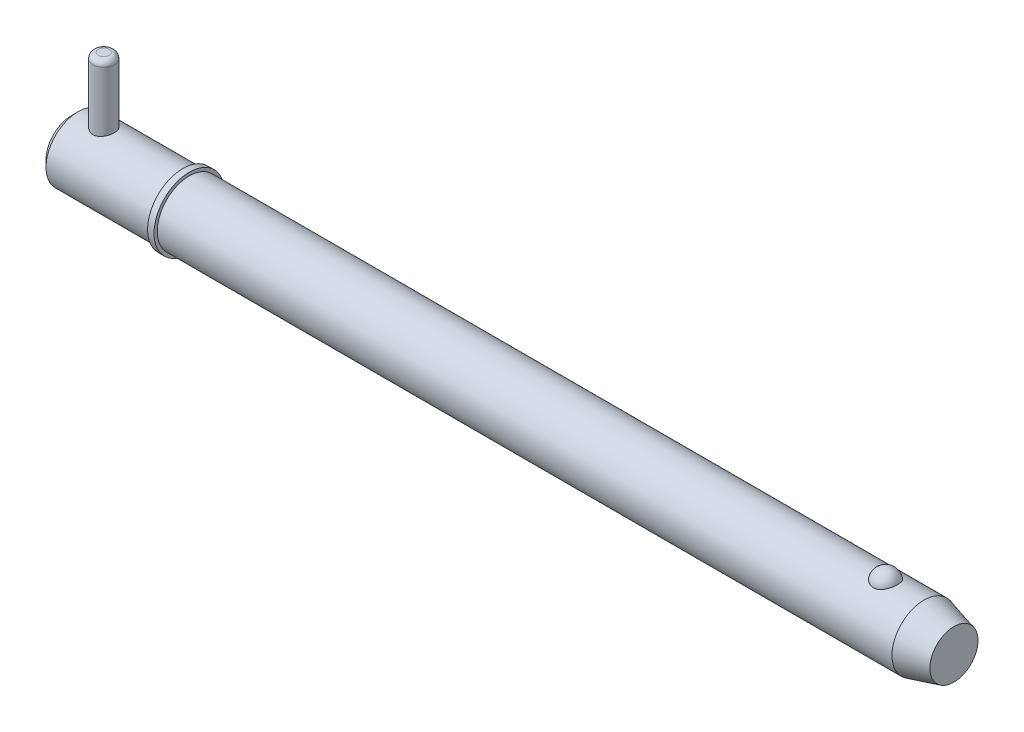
ISO-10303-21;
HEADER;
FILE_DESCRIPTION(('STEP AP214'),'2;1');
FILE_NAME('part.step','',(''),(''),'','','');
FILE_SCHEMA(('AUTOMOTIVE_DESIGN { 1 0 10303 214 1 1 1 1 }'));
ENDSEC;
DATA;
#1=APPLICATION_CONTEXT('core data for automotive mechanical design processes');
#2=APPLICATION_PROTOCOL_DEFINITION('international standard','automotive_design',2000,#1);
#3=PRODUCT_CONTEXT('',#1,'mechanical');
#4=PRODUCT('Part','Part','',(#3));
#5=PRODUCT_RELATED_PRODUCT_CATEGORY('part','',(#4));
#6=PRODUCT_DEFINITION_FORMATION('','',#4);
#7=PRODUCT_DEFINITION_CONTEXT('part definition',#1,'design');
#8=PRODUCT_DEFINITION('design','',#6,#7);
#9=PRODUCT_DEFINITION_SHAPE('','',#8);
#10=(LENGTH_UNIT() NAMED_UNIT(*) SI_UNIT(.MILLI.,.METRE.));
#11=(NAMED_UNIT(*) PLANE_ANGLE_UNIT() SI_UNIT($,.RADIAN.));
#12=(NAMED_UNIT(*) SI_UNIT($,.STERADIAN.) SOLID_ANGLE_UNIT());
#13=UNCERTAINTY_MEASURE_WITH_UNIT(LENGTH_MEASURE(1.E-05),#10,'distance_accuracy_value','');
#14=(GEOMETRIC_REPRESENTATION_CONTEXT(3) GLOBAL_UNCERTAINTY_ASSIGNED_CONTEXT((#13)) GLOBAL_UNIT_ASSIGNED_CONTEXT((#10,
#11,#12)) REPRESENTATION_CONTEXT('',''));
#15=CARTESIAN_POINT('',(0.,0.,0.));
#16=DIRECTION('',(0.,0.,1.));
#17=DIRECTION('',(1.,0.,0.));
#18=AXIS2_PLACEMENT_3D('',#15,#16,#17);
#19=CARTESIAN_POINT('',(9.52500000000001,28.575,0.));
#20=DIRECTION('',(0.,-1.,0.));
#21=DIRECTION('',(0.,0.,-1.));
#22=AXIS2_PLACEMENT_3D('',#19,#20,#21);
#23=CYLINDRICAL_SURFACE('',#22,3.175);
#24=CARTESIAN_POINT('',(9.52500000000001,-7.93750000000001,0.));
#25=DIRECTION('',(0.,1.,0.));
#26=DIRECTION('',(0.,0.,1.));
#27=AXIS2_PLACEMENT_3D('',#24,#25,#26);
#28=CIRCLE('',#27,3.175);
#29=CARTESIAN_POINT('',(9.52500000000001,-7.93750000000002,-3.175));
#30=VERTEX_POINT('',#29);
#31=EDGE_CURVE('P0_E25',#30,#30,#28,.T.);
#32=CARTESIAN_POINT('',(9.52500000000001,26.9875,0.));
#33=DIRECTION('',(0.,1.,0.));
#34=DIRECTION('',(0.,0.,1.));
#35=AXIS2_PLACEMENT_3D('',#32,#33,#34);
#36=CIRCLE('',#35,3.175);
#37=CARTESIAN_POINT('',(9.52500000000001,26.9875,-3.175));
#38=VERTEX_POINT('',#37);
#39=EDGE_CURVE('P0_E29',#38,#38,#36,.F.);
#40=CARTESIAN_POINT('',(9.52500000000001,-7.93750000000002,-3.175));
#41=CARTESIAN_POINT('',(9.52500000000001,-7.57369791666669,-3.175));
#42=CARTESIAN_POINT('',(9.52500000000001,-7.20989583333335,-3.175));
#43=CARTESIAN_POINT('',(9.52500000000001,-6.48229166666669,-3.175));
#44=CARTESIAN_POINT('',(9.52500000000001,-6.11848958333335,-3.175));
#45=CARTESIAN_POINT('',(9.52500000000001,-5.39088541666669,-3.175));
#46=CARTESIAN_POINT('',(9.52500000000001,-5.02708333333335,-3.175));
#47=CARTESIAN_POINT('',(9.52500000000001,-4.29947916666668,-3.175));
#48=CARTESIAN_POINT('',(9.52500000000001,-3.93567708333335,-3.175));
#49=CARTESIAN_POINT('',(9.52500000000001,-3.20807291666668,-3.175));
#50=CARTESIAN_POINT('',(9.52500000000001,-2.84427083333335,-3.175));
#51=CARTESIAN_POINT('',(9.52500000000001,-2.11666666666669,-3.175));
#52=CARTESIAN_POINT('',(9.52500000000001,-1.75286458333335,-3.175));
#53=CARTESIAN_POINT('',(9.52500000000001,-1.02526041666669,-3.175));
#54=CARTESIAN_POINT('',(9.52500000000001,-0.661458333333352,-3.175));
#55=CARTESIAN_POINT('',(9.52500000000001,0.0661458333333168,-3.175));
#56=CARTESIAN_POINT('',(9.52500000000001,0.429947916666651,-3.175));
#57=CARTESIAN_POINT('',(9.52500000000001,1.15755208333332,-3.175));
#58=CARTESIAN_POINT('',(9.52500000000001,1.52135416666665,-3.175));
#59=CARTESIAN_POINT('',(9.52500000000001,2.24895833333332,-3.175));
#60=CARTESIAN_POINT('',(9.52500000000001,2.61276041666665,-3.175));
#61=CARTESIAN_POINT('',(9.52500000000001,3.34036458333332,-3.175));
#62=CARTESIAN_POINT('',(9.52500000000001,3.70416666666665,-3.175));
#63=CARTESIAN_POINT('',(9.52500000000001,4.43177083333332,-3.175));
#64=CARTESIAN_POINT('',(9.52500000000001,4.79557291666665,-3.175));
#65=CARTESIAN_POINT('',(9.52500000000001,5.52317708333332,-3.175));
#66=CARTESIAN_POINT('',(9.52500000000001,5.88697916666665,-3.175));
#67=CARTESIAN_POINT('',(9.52500000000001,6.61458333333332,-3.175));
#68=CARTESIAN_POINT('',(9.52500000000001,6.97838541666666,-3.175));
#69=CARTESIAN_POINT('',(9.52500000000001,7.70598958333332,-3.175));
#70=CARTESIAN_POINT('',(9.52500000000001,8.06979166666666,-3.175));
#71=CARTESIAN_POINT('',(9.52500000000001,8.79739583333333,-3.175));
#72=CARTESIAN_POINT('',(9.52500000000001,9.16119791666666,-3.175));
#73=CARTESIAN_POINT('',(9.52500000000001,9.88880208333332,-3.175));
#74=CARTESIAN_POINT('',(9.52500000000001,10.2526041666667,-3.175));
#75=CARTESIAN_POINT('',(9.52500000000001,10.9802083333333,-3.175));
#76=CARTESIAN_POINT('',(9.52500000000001,11.3440104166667,-3.175));
#77=CARTESIAN_POINT('',(9.52500000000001,12.0716145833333,-3.175));
#78=CARTESIAN_POINT('',(9.52500000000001,12.4354166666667,-3.175));
#79=CARTESIAN_POINT('',(9.52500000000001,13.1630208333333,-3.175));
#80=CARTESIAN_POINT('',(9.52500000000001,13.5268229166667,-3.175));
#81=CARTESIAN_POINT('',(9.52500000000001,14.2544270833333,-3.175));
#82=CARTESIAN_POINT('',(9.52500000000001,14.6182291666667,-3.175));
#83=CARTESIAN_POINT('',(9.52500000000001,15.3458333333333,-3.175));
#84=CARTESIAN_POINT('',(9.52500000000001,15.7096354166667,-3.175));
#85=CARTESIAN_POINT('',(9.52500000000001,16.4372395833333,-3.175));
#86=CARTESIAN_POINT('',(9.52500000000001,16.8010416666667,-3.175));
#87=CARTESIAN_POINT('',(9.52500000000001,17.5286458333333,-3.175));
#88=CARTESIAN_POINT('',(9.52500000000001,17.8924479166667,-3.175));
#89=CARTESIAN_POINT('',(9.52500000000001,18.6200520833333,-3.175));
#90=CARTESIAN_POINT('',(9.52500000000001,18.9838541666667,-3.175));
#91=CARTESIAN_POINT('',(9.52500000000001,19.7114583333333,-3.175));
#92=CARTESIAN_POINT('',(9.52500000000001,20.0752604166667,-3.175));
#93=CARTESIAN_POINT('',(9.52500000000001,20.8028645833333,-3.175));
#94=CARTESIAN_POINT('',(9.52500000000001,21.1666666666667,-3.175));
#95=CARTESIAN_POINT('',(9.52500000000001,21.8942708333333,-3.175));
#96=CARTESIAN_POINT('',(9.52500000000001,22.2580729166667,-3.175));
#97=CARTESIAN_POINT('',(9.52500000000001,22.9856770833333,-3.175));
#98=CARTESIAN_POINT('',(9.52500000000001,23.3494791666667,-3.175));
#99=CARTESIAN_POINT('',(9.52500000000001,24.0770833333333,-3.175));
#100=CARTESIAN_POINT('',(9.52500000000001,24.4408854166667,-3.175));
#101=CARTESIAN_POINT('',(9.52500000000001,25.1684895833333,-3.175));
#102=CARTESIAN_POINT('',(9.52500000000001,25.5322916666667,-3.175));
#103=CARTESIAN_POINT('',(9.52500000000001,26.2598958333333,-3.175));
#104=CARTESIAN_POINT('',(9.52500000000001,26.6236979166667,-3.175));
#105=CARTESIAN_POINT('',(9.52500000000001,26.9875,-3.175));
#106=B_SPLINE_CURVE_WITH_KNOTS('',3,(#40,#41,#42,#43,#44,#45,#46,#47,#48,#49,#50,#51,#52,#53,
#54,#55,#56,#57,#58,#59,#60,#61,#62,#63,#64,#65,#66,#67,#68,#69,#70,#71,#72,#73,#74,#75,#76,#77,
#78,#79,#80,#81,#82,#83,#84,#85,#86,#87,#88,#89,#90,#91,#92,#93,#94,#95,#96,#97,#98,#99,#100,
#101,#102,#103,#104,#105),.UNSPECIFIED.,.F.,.F.,(4,2,2,2,2,2,2,2,2,2,2,2,2,2,2,2,2,2,2,2,2,2,2,
2,2,2,2,2,2,2,2,2,4),(0.,1.09140625,2.1828125,3.27421875,4.365625,5.45703125,6.5484375,
7.63984375,8.73125000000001,9.82265625,10.9140625,12.00546875,13.096875,14.18828125,15.2796875,
16.37109375,17.4625,18.55390625,19.6453125,20.73671875,21.828125,22.91953125,24.0109375,
25.10234375,26.19375,27.28515625,28.3765625,29.46796875,30.559375,31.65078125,32.7421875,
33.83359375,34.925),.UNSPECIFIED.);
#107=EDGE_CURVE('P0_BSEAM14',#30,#38,#106,.T.);
#108=ORIENTED_EDGE('',*,*,#31,.T.);
#109=ORIENTED_EDGE('',*,*,#39,.T.);
#110=ORIENTED_EDGE('',*,*,#107,.T.);
#111=ORIENTED_EDGE('',*,*,#107,.F.);
#112=EDGE_LOOP('',(#108,#110,#109,#111));
#113=FACE_BOUND('',#112,.T.);
#114=ADVANCED_FACE('P0_F14',(#113),#23,.T.);
#115=CARTESIAN_POINT('',(9.52500000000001,28.575,0.));
#116=DIRECTION('',(0.,1.,0.));
#117=DIRECTION('',(0.,0.,1.));
#118=AXIS2_PLACEMENT_3D('',#115,#116,#117);
#119=PLANE('',#118);
#120=CARTESIAN_POINT('',(9.52500000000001,28.575,0.));
#121=DIRECTION('',(0.,1.,0.));
#122=DIRECTION('',(0.,0.,1.));
#123=AXIS2_PLACEMENT_3D('',#120,#121,#122);
#124=CIRCLE('',#123,1.5875);
#125=CARTESIAN_POINT('',(9.52500000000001,28.575,1.5875));
#126=VERTEX_POINT('',#125);
#127=EDGE_CURVE('P0_E10',#126,#126,#124,.T.);
#128=ORIENTED_EDGE('',*,*,#127,.T.);
#129=EDGE_LOOP('',(#128));
#130=FACE_BOUND('',#129,.T.);
#131=ADVANCED_FACE('P0_F46',(#130),#119,.T.);
#132=CARTESIAN_POINT('',(9.52500000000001,-9.525,0.));
#133=DIRECTION('',(0.,1.,0.));
#134=DIRECTION('',(0.,0.,1.));
#135=AXIS2_PLACEMENT_3D('',#132,#133,#134);
#136=PLANE('',#135);
#137=CARTESIAN_POINT('',(9.52500000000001,-9.525,0.));
#138=DIRECTION('',(0.,1.,0.));
#139=DIRECTION('',(0.,0.,1.));
#140=AXIS2_PLACEMENT_3D('',#137,#138,#139);
#141=CIRCLE('',#140,1.5875);
#142=CARTESIAN_POINT('',(9.52500000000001,-9.525,1.5875));
#143=VERTEX_POINT('',#142);
#144=EDGE_CURVE('P0_E21',#143,#143,#141,.F.);
#145=ORIENTED_EDGE('',*,*,#144,.T.);
#146=EDGE_LOOP('',(#145));
#147=FACE_BOUND('',#146,.T.);
#148=ADVANCED_FACE('P0_F43',(#147),#136,.F.);
#149=CARTESIAN_POINT('',(9.52500000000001,-7.9375,0.));
#150=DIRECTION('',(0.,1.,0.));
#151=DIRECTION('',(0.,0.,1.));
#152=AXIS2_PLACEMENT_3D('',#149,#150,#151);
#153=DEGENERATE_TOROIDAL_SURFACE('',#152,1.5875,1.5875,.T.);
#154=ORIENTED_EDGE('',*,*,#144,.F.);
#155=EDGE_LOOP('',(#154));
#156=FACE_BOUND('',#155,.T.);
#157=ORIENTED_EDGE('',*,*,#31,.F.);
#158=EDGE_LOOP('',(#157));
#159=FACE_BOUND('',#158,.T.);
#160=ADVANCED_FACE('P0_F38',(#156,#159),#153,.T.);
#161=CARTESIAN_POINT('',(9.52500000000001,26.9875,0.));
#162=DIRECTION('',(0.,1.,0.));
#163=DIRECTION('',(0.,0.,1.));
#164=AXIS2_PLACEMENT_3D('',#161,#162,#163);
#165=DEGENERATE_TOROIDAL_SURFACE('',#164,1.5875,1.5875,.T.);
#166=ORIENTED_EDGE('',*,*,#39,.F.);
#167=EDGE_LOOP('',(#166));
#168=FACE_BOUND('',#167,.T.);
#169=ORIENTED_EDGE('',*,*,#127,.F.);
#170=EDGE_LOOP('',(#169));
#171=FACE_BOUND('',#170,.T.);
#172=ADVANCED_FACE('P0_F16',(#168,#171),#165,.T.);
#173=CLOSED_SHELL('',(#114,#131,#148,#160,#172));
#174=MANIFOLD_SOLID_BREP('P0_B1',#173);
#175=CARTESIAN_POINT('',(0.,0.,0.));
#176=DIRECTION('',(1.,0.,0.));
#177=DIRECTION('',(0.,0.,-1.));
#178=AXIS2_PLACEMENT_3D('',#175,#176,#177);
#179=CYLINDRICAL_SURFACE('',#178,9.525);
#180=CARTESIAN_POINT('',(253.043054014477,0.,0.));
#181=DIRECTION('',(1.,0.,0.));
#182=DIRECTION('',(0.,0.,-1.));
#183=AXIS2_PLACEMENT_3D('',#180,#181,#182);
#184=CIRCLE('',#183,9.525);
#185=CARTESIAN_POINT('',(253.043054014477,0.,-9.525));
#186=VERTEX_POINT('',#185);
#187=EDGE_CURVE('P1_E81',#186,#186,#184,.T.);
#188=ORIENTED_EDGE('',*,*,#187,.F.);
#189=EDGE_LOOP('',(#188));
#190=FACE_BOUND('',#189,.T.);
#191=CARTESIAN_POINT('',(34.93,0.,0.));
#192=DIRECTION('',(1.,0.,0.));
#193=DIRECTION('',(0.,0.,-1.));
#194=AXIS2_PLACEMENT_3D('',#191,#192,#193);
#195=CIRCLE('',#194,9.525);
#196=CARTESIAN_POINT('',(34.93,0.,-9.525));
#197=VERTEX_POINT('',#196);
#198=EDGE_CURVE('P1_E85',#197,#197,#195,.T.);
#199=ORIENTED_EDGE('',*,*,#198,.T.);
#200=EDGE_LOOP('',(#199));
#201=FACE_BOUND('',#200,.T.);
#202=CARTESIAN_POINT('',(241.645757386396,8.80405803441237,3.63513233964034));
#203=CARTESIAN_POINT('',(241.551676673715,8.80405953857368,3.63513053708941));
#204=CARTESIAN_POINT('',(241.457561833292,8.80561325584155,3.63137461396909));
#205=CARTESIAN_POINT('',(241.270012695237,8.81177748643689,3.61638665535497));
#206=CARTESIAN_POINT('',(241.176578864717,8.81638992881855,3.60514990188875));
#207=CARTESIAN_POINT('',(240.897945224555,8.83467114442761,3.56024627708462));
#208=CARTESIAN_POINT('',(240.714691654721,8.85278327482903,3.51538626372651));
#209=CARTESIAN_POINT('',(240.359509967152,8.89871214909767,3.39742145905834));
#210=CARTESIAN_POINT('',(240.187553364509,8.92650327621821,3.32439116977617));
#211=CARTESIAN_POINT('',(239.858707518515,8.98874819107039,3.15220244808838));
#212=CARTESIAN_POINT('',(239.701811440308,9.02319893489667,3.05305594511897));
#213=CARTESIAN_POINT('',(239.402214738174,9.09629186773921,2.82797815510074));
#214=CARTESIAN_POINT('',(239.260060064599,9.13502685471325,2.70135138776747));
#215=CARTESIAN_POINT('',(238.998299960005,9.21186572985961,2.42641932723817));
#216=CARTESIAN_POINT('',(238.878701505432,9.24996941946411,2.2781073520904));
#217=CARTESIAN_POINT('',(238.659645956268,9.32341082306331,1.95652290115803));
#218=CARTESIAN_POINT('',(238.561317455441,9.35855090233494,1.78243511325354));
#219=CARTESIAN_POINT('',(238.393819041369,9.42045142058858,1.41937246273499));
#220=CARTESIAN_POINT('',(238.324651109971,9.44721128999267,1.23039658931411));
#221=CARTESIAN_POINT('',(238.216199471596,9.48990641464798,0.84037088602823));
#222=CARTESIAN_POINT('',(238.177288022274,9.50570658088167,0.639202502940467));
#223=CARTESIAN_POINT('',(238.131555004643,9.52433146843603,0.232664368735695));
#224=CARTESIAN_POINT('',(238.124732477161,9.52715657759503,0.0272947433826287));
#225=CARTESIAN_POINT('',(238.143255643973,9.51956918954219,-0.380478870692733));
#226=CARTESIAN_POINT('',(238.168405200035,9.50923740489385,-0.582893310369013));
#227=CARTESIAN_POINT('',(238.25002537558,9.47651897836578,-0.98029399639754));
#228=CARTESIAN_POINT('',(238.306496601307,9.45413210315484,-1.17528009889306));
#229=CARTESIAN_POINT('',(238.449719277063,9.39954044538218,-1.55263697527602));
#230=CARTESIAN_POINT('',(238.536512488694,9.36732213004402,-1.73498993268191));
#231=CARTESIAN_POINT('',(238.738610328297,9.29640700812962,-2.08177763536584));
#232=CARTESIAN_POINT('',(238.853917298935,9.25770966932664,-2.24621090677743));
#233=CARTESIAN_POINT('',(239.111264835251,9.17775604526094,-2.5533833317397));
#234=CARTESIAN_POINT('',(239.253434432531,9.136488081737,-2.696011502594));
#235=CARTESIAN_POINT('',(239.56089985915,9.05620497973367,-2.95451229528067));
#236=CARTESIAN_POINT('',(239.726193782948,9.01718965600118,-3.07038711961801));
#237=CARTESIAN_POINT('',(240.072052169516,8.94680019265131,-3.26976836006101));
#238=CARTESIAN_POINT('',(240.252227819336,8.91528408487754,-3.35389750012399));
#239=CARTESIAN_POINT('',(240.625651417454,8.86272514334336,-3.49043503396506));
#240=CARTESIAN_POINT('',(240.818894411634,8.84167836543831,-3.54285537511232));
#241=CARTESIAN_POINT('',(241.202503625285,8.81348056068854,-3.61241306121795));
#242=CARTESIAN_POINT('',(241.392525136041,8.80568348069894,-3.6311933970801));
#243=CARTESIAN_POINT('',(241.773190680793,8.80289410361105,-3.63795342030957));
#244=CARTESIAN_POINT('',(241.963834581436,8.80789922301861,-3.62593932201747));
#245=CARTESIAN_POINT('',(242.334007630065,8.82974915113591,-3.57238430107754));
#246=CARTESIAN_POINT('',(242.513697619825,8.84621463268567,-3.53178890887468));
#247=CARTESIAN_POINT('',(242.863422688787,8.88875330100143,-3.42331083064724));
#248=CARTESIAN_POINT('',(243.033456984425,8.91482726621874,-3.35542593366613));
#249=CARTESIAN_POINT('',(243.363237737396,8.97448239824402,-3.19248225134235));
#250=CARTESIAN_POINT('',(243.522680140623,9.00821446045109,-3.0968647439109));
#251=CARTESIAN_POINT('',(243.823513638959,9.07935398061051,-2.88162736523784));
#252=CARTESIAN_POINT('',(243.964900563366,9.11676228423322,-2.76200196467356));
#253=CARTESIAN_POINT('',(244.23331931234,9.19347419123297,-2.49516285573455));
#254=CARTESIAN_POINT('',(244.359275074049,9.23277872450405,-2.34686614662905));
#255=CARTESIAN_POINT('',(244.585522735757,9.3073761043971,-2.03093683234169));
#256=CARTESIAN_POINT('',(244.68581004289,9.34266823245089,-1.86330077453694));
#257=CARTESIAN_POINT('',(244.861514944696,9.40674710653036,-1.50744893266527));
#258=CARTESIAN_POINT('',(244.936041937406,9.43529176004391,-1.31874876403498));
#259=CARTESIAN_POINT('',(245.05416505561,9.48144132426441,-0.930631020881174));
#260=CARTESIAN_POINT('',(245.097760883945,9.49904612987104,-0.731213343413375));
#261=CARTESIAN_POINT('',(245.153158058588,9.5215314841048,-0.327147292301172));
#262=CARTESIAN_POINT('',(245.164935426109,9.52640243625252,-0.122495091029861));
#263=CARTESIAN_POINT('',(245.156382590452,9.5228957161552,0.28601848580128));
#264=CARTESIAN_POINT('',(245.13605305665,9.5145183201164,0.489879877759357));
#265=CARTESIAN_POINT('',(245.063884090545,9.48544083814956,0.889994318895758));
#266=CARTESIAN_POINT('',(245.012199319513,9.46480124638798,1.08627971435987));
#267=CARTESIAN_POINT('',(244.878491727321,9.4133389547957,1.46682086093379));
#268=CARTESIAN_POINT('',(244.796466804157,9.38251554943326,1.65107577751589));
#269=CARTESIAN_POINT('',(244.60319292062,9.31365636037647,2.00346348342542));
#270=CARTESIAN_POINT('',(244.491783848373,9.27558138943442,2.17150083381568));
#271=CARTESIAN_POINT('',(244.242294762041,9.19638714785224,2.48563115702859));
#272=CARTESIAN_POINT('',(244.104216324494,9.15526805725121,2.63172542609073));
#273=CARTESIAN_POINT('',(243.804843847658,9.07465393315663,2.89750997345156));
#274=CARTESIAN_POINT('',(243.643610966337,9.03515496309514,3.01726776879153));
#275=CARTESIAN_POINT('',(243.301613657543,8.96227564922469,3.22732920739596));
#276=CARTESIAN_POINT('',(243.120841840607,8.92889763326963,3.31762165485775));
#277=CARTESIAN_POINT('',(242.751445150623,8.8734538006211,3.46314419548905));
#278=CARTESIAN_POINT('',(242.56332371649,8.85102983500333,3.51950082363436));
#279=CARTESIAN_POINT('',(242.27578699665,8.82666967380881,3.57993683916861));
#280=CARTESIAN_POINT('',(242.179133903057,8.82009725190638,3.59606217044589));
#281=CARTESIAN_POINT('',(241.984677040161,8.81020897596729,3.62022512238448));
#282=CARTESIAN_POINT('',(241.886874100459,8.80689090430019,3.62826825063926));
#283=CARTESIAN_POINT('',(241.741224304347,8.80445615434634,3.63416760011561));
#284=CARTESIAN_POINT('',(241.693495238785,8.80405727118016,3.63513325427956));
#285=CARTESIAN_POINT('',(241.645757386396,8.80405803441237,3.63513233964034));
#286=B_SPLINE_CURVE_WITH_KNOTS('',3,(#202,#203,#204,#205,#206,#207,#208,#209,#210,#211,#212,
#213,#214,#215,#216,#217,#218,#219,#220,#221,#222,#223,#224,#225,#226,#227,#228,#229,#230,#231,
#232,#233,#234,#235,#236,#237,#238,#239,#240,#241,#242,#243,#244,#245,#246,#247,#248,#249,#250,
#251,#252,#253,#254,#255,#256,#257,#258,#259,#260,#261,#262,#263,#264,#265,#266,#267,#268,#269,
#270,#271,#272,#273,#274,#275,#276,#277,#278,#279,#280,#281,#282,#283,#284,#285),.UNSPECIFIED.,
.T.,.F.,(4,2,2,2,2,2,2,2,2,2,2,2,2,2,2,2,2,2,2,2,2,2,2,2,2,2,2,2,2,2,2,2,2,2,2,2,2,2,2,2,2,4),
(0.,0.282202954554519,0.564584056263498,1.13017050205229,1.69427128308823,2.25811483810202,
2.83836627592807,3.41879688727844,4.02497117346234,4.63118665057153,5.24474754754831,
5.85829010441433,6.46808687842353,7.07789545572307,7.68854723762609,8.299249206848,
8.91296283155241,9.52662591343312,10.1275338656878,10.7282152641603,11.2986646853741,
11.8689989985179,12.4213015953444,12.973648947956,13.5380053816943,14.1024919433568,
14.695298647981,15.2882113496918,15.8999469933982,16.5116885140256,17.1238909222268,
17.7360805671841,18.3452748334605,18.9545113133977,19.567138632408,20.179729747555,
20.7907316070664,21.4019653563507,21.9915938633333,22.2859053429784,22.5800161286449,
22.7232098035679),.UNSPECIFIED.);
#287=CARTESIAN_POINT('',(241.645757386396,8.80405803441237,3.63513233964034));
#288=VERTEX_POINT('',#287);
#289=EDGE_CURVE('P1_E35',#288,#288,#286,.T.);
#290=ORIENTED_EDGE('',*,*,#289,.T.);
#291=EDGE_LOOP('',(#290));
#292=FACE_BOUND('',#291,.T.);
#293=ADVANCED_FACE('P1_F13',(#190,#201,#292),#179,.T.);
#294=CARTESIAN_POINT('',(0.,0.,0.));
#295=DIRECTION('',(-1.,0.,0.));
#296=DIRECTION('',(0.,0.,1.));
#297=AXIS2_PLACEMENT_3D('',#294,#295,#296);
#298=PLANE('',#297);
#299=CARTESIAN_POINT('',(0.,0.,0.));
#300=DIRECTION('',(1.,0.,0.));
#301=DIRECTION('',(0.,0.,-1.));
#302=AXIS2_PLACEMENT_3D('',#299,#300,#301);
#303=CIRCLE('',#302,7.62);
#304=CARTESIAN_POINT('',(0.,0.,-7.62));
#305=VERTEX_POINT('',#304);
#306=EDGE_CURVE('P1_E9',#305,#305,#303,.T.);
#307=ORIENTED_EDGE('',*,*,#306,.F.);
#308=EDGE_LOOP('',(#307));
#309=FACE_BOUND('',#308,.T.);
#310=ADVANCED_FACE('P1_F15',(#309),#298,.T.);
#311=CARTESIAN_POINT('',(1.90499999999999,0.,0.));
#312=DIRECTION('',(1.,0.,0.));
#313=DIRECTION('',(0.,0.,-1.));
#314=AXIS2_PLACEMENT_3D('',#311,#312,#313);
#315=CONICAL_SURFACE('',#314,9.525,0.785398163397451);
#316=ORIENTED_EDGE('',*,*,#306,.T.);
#317=EDGE_LOOP('',(#316));
#318=FACE_BOUND('',#317,.T.);
#319=CARTESIAN_POINT('',(1.90499999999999,0.,0.));
#320=DIRECTION('',(1.,0.,0.));
#321=DIRECTION('',(0.,0.,-1.));
#322=AXIS2_PLACEMENT_3D('',#319,#320,#321);
#323=CIRCLE('',#322,9.525);
#324=CARTESIAN_POINT('',(1.90499999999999,0.,-9.525));
#325=VERTEX_POINT('',#324);
#326=EDGE_CURVE('P1_E26',#325,#325,#323,.T.);
#327=ORIENTED_EDGE('',*,*,#326,.F.);
#328=EDGE_LOOP('',(#327));
#329=FACE_BOUND('',#328,.T.);
#330=ADVANCED_FACE('P1_F77',(#318,#329),#315,.T.);
#331=CARTESIAN_POINT('',(0.,0.,0.));
#332=DIRECTION('',(1.,0.,0.));
#333=DIRECTION('',(0.,0.,-1.));
#334=AXIS2_PLACEMENT_3D('',#331,#332,#333);
#335=CYLINDRICAL_SURFACE('',#334,9.525);
#336=CARTESIAN_POINT('',(9.525,-8.98025612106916,3.175));
#337=CARTESIAN_POINT('',(9.35206354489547,-8.98025555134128,3.17500081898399));
#338=CARTESIAN_POINT('',(9.17913201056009,-8.98530617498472,3.16082293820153));
#339=CARTESIAN_POINT('',(8.83839221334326,-9.00485797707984,3.10467734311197));
#340=CARTESIAN_POINT('',(8.67058479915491,-9.0193607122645,3.06270505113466));
#341=CARTESIAN_POINT('',(8.34508461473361,-9.05599546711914,2.95260866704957));
#342=CARTESIAN_POINT('',(8.18737272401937,-9.07811252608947,2.88453582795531));
#343=CARTESIAN_POINT('',(7.88555684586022,-9.12746212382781,2.72434567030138));
#344=CARTESIAN_POINT('',(7.74145587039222,-9.1546957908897,2.63222304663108));
#345=CARTESIAN_POINT('',(7.46531411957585,-9.21240503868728,2.42268738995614));
#346=CARTESIAN_POINT('',(7.33388351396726,-9.24296141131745,2.30449228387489));
#347=CARTESIAN_POINT('',(7.09229340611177,-9.30319020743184,2.0478358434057));
#348=CARTESIAN_POINT('',(6.98213731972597,-9.33286248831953,1.90937126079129));
#349=CARTESIAN_POINT('',(6.78345450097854,-9.38891527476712,1.61164431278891));
#350=CARTESIAN_POINT('',(6.69556709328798,-9.41518969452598,1.45193356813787));
#351=CARTESIAN_POINT('',(6.54814671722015,-9.46053437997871,1.11896913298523));
#352=CARTESIAN_POINT('',(6.48860610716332,-9.47960658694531,0.945719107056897));
#353=CARTESIAN_POINT('',(6.40163866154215,-9.50782564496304,0.596991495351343));
#354=CARTESIAN_POINT('',(6.373166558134,-9.5172947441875,0.421801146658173));
#355=CARTESIAN_POINT('',(6.3458207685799,-9.52638456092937,0.068890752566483));
#356=CARTESIAN_POINT('',(6.34693945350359,-9.52600781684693,-0.108828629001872));
#357=CARTESIAN_POINT('',(6.37808050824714,-9.51566675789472,-0.454353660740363));
#358=CARTESIAN_POINT('',(6.4069675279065,-9.50607905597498,-0.622274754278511));
#359=CARTESIAN_POINT('',(6.490947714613,-9.47886621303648,-0.950732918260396));
#360=CARTESIAN_POINT('',(6.54604265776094,-9.46124052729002,-1.11126948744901));
#361=CARTESIAN_POINT('',(6.68153768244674,-9.41945253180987,-1.42288410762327));
#362=CARTESIAN_POINT('',(6.76226085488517,-9.3952073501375,-1.57381010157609));
#363=CARTESIAN_POINT('',(6.94645456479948,-9.34270397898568,-1.86030973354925));
#364=CARTESIAN_POINT('',(7.04993142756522,-9.31444467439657,-1.99587908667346));
#365=CARTESIAN_POINT('',(7.28241619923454,-9.25532159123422,-2.2545702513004));
#366=CARTESIAN_POINT('',(7.4123967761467,-9.22439783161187,-2.37680549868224));
#367=CARTESIAN_POINT('',(7.69127470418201,-9.1645528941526,-2.5980302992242));
#368=CARTESIAN_POINT('',(7.84017496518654,-9.13563202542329,-2.6970162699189));
#369=CARTESIAN_POINT('',(8.15547526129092,-9.08273917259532,-2.87016016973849));
#370=CARTESIAN_POINT('',(8.32209451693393,-9.05884361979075,-2.94394402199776));
#371=CARTESIAN_POINT('',(8.66638917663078,-9.01959241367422,-3.06210713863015));
#372=CARTESIAN_POINT('',(8.84405991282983,-9.00423318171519,-3.10649872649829));
#373=CARTESIAN_POINT('',(9.19682677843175,-8.98460345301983,-3.16281207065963));
#374=CARTESIAN_POINT('',(9.37167742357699,-8.9798639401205,-3.17610837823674));
#375=CARTESIAN_POINT('',(9.72113927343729,-8.9806993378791,-3.17374726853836));
#376=CARTESIAN_POINT('',(9.89575051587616,-8.98627237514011,-3.15809511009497));
#377=CARTESIAN_POINT('',(10.2335233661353,-9.00663737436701,-3.09951644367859));
#378=CARTESIAN_POINT('',(10.3968722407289,-9.02110608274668,-3.05754530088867));
#379=CARTESIAN_POINT('',(10.7141759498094,-9.05727657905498,-2.94866651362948));
#380=CARTESIAN_POINT('',(10.8681291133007,-9.07897964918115,-2.88175444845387));
#381=CARTESIAN_POINT('',(11.1676828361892,-9.12802586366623,-2.72248103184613));
#382=CARTESIAN_POINT('',(11.3128635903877,-9.1555260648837,-2.62937980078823));
#383=CARTESIAN_POINT('',(11.5860387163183,-9.21276315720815,-2.42120937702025));
#384=CARTESIAN_POINT('',(11.7140280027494,-9.24250070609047,-2.30613370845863));
#385=CARTESIAN_POINT('',(11.9555513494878,-9.30259247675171,-2.05070616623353));
#386=CARTESIAN_POINT('',(12.0680936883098,-9.33290753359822,-1.90940458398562));
#387=CARTESIAN_POINT('',(12.267933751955,-9.3893275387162,-1.60917665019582));
#388=CARTESIAN_POINT('',(12.3552323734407,-9.41543263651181,-1.45025092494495));
#389=CARTESIAN_POINT('',(12.5013088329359,-9.46036988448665,-1.12007606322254));
#390=CARTESIAN_POINT('',(12.5602723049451,-9.47924920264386,-0.9489158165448));
#391=CARTESIAN_POINT('',(12.6483355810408,-9.50781089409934,-0.598355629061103));
#392=CARTESIAN_POINT('',(12.6774461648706,-9.5174965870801,-0.4189586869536));
#393=CARTESIAN_POINT('',(12.7040070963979,-9.52632915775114,-0.066088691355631));
#394=CARTESIAN_POINT('',(12.7028811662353,-9.52594996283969,0.107266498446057));
#395=CARTESIAN_POINT('',(12.6725130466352,-9.51586223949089,0.451202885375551));
#396=CARTESIAN_POINT('',(12.643273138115,-9.50615446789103,0.621784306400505));
#397=CARTESIAN_POINT('',(12.5584514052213,-9.47867404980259,0.952633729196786));
#398=CARTESIAN_POINT('',(12.5032953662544,-9.46103195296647,1.1130225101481));
#399=CARTESIAN_POINT('',(12.3686013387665,-9.41949985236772,1.42233126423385));
#400=CARTESIAN_POINT('',(12.2890589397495,-9.39560871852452,1.57124915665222));
#401=CARTESIAN_POINT('',(12.1044667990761,-9.34294133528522,1.85938800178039));
#402=CARTESIAN_POINT('',(11.9985831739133,-9.31401720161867,1.9980473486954));
#403=CARTESIAN_POINT('',(11.7657327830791,-9.25490239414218,2.25609475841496));
#404=CARTESIAN_POINT('',(11.6387592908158,-9.22471131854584,2.37547664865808));
#405=CARTESIAN_POINT('',(11.3613902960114,-9.16505913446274,2.59633024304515));
#406=CARTESIAN_POINT('',(11.2102725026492,-9.13567286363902,2.69691791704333));
#407=CARTESIAN_POINT('',(10.8923631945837,-9.08241113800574,2.87119803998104));
#408=CARTESIAN_POINT('',(10.7255757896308,-9.05853424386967,2.94489751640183));
#409=CARTESIAN_POINT('',(10.3887212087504,-9.02021736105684,3.06020415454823));
#410=CARTESIAN_POINT('',(10.219143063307,-9.00539959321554,3.10311136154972));
#411=CARTESIAN_POINT('',(9.87470703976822,-8.98542092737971,3.16050396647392));
#412=CARTESIAN_POINT('',(9.699851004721,-8.98025669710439,3.17499917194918));
#413=CARTESIAN_POINT('',(9.525,-8.98025612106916,3.175));
#414=B_SPLINE_CURVE_WITH_KNOTS('',3,(#336,#337,#338,#339,#340,#341,#342,#343,#344,#345,#346,
#347,#348,#349,#350,#351,#352,#353,#354,#355,#356,#357,#358,#359,#360,#361,#362,#363,#364,#365,
#366,#367,#368,#369,#370,#371,#372,#373,#374,#375,#376,#377,#378,#379,#380,#381,#382,#383,#384,
#385,#386,#387,#388,#389,#390,#391,#392,#393,#394,#395,#396,#397,#398,#399,#400,#401,#402,#403,
#404,#405,#406,#407,#408,#409,#410,#411,#412,#413),.UNSPECIFIED.,.T.,.F.,(4,2,2,2,2,2,2,2,2,2,2,
2,2,2,2,2,2,2,2,2,2,2,2,2,2,2,2,2,2,2,2,2,2,2,2,2,2,2,4),(0.,0.518161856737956,1.03640907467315,
1.55364379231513,2.07099270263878,2.60671746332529,3.14252816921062,3.69231882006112,
4.24196117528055,4.77247962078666,5.30286129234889,5.81244090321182,6.32205505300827,
6.83836754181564,7.3548237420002,7.89559553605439,8.43645060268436,8.98501631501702,
9.53335188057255,10.056948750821,10.5804505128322,11.0859695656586,11.5915782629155,
12.1132237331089,12.6350231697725,13.1819271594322,13.7288117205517,14.2720628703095,
14.815117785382,15.3326491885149,15.8501386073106,16.3594083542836,16.868770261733,
17.3969527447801,17.925304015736,18.4743376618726,19.023227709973,19.5473069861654,
20.0712053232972),.UNSPECIFIED.);
#415=CARTESIAN_POINT('',(9.525,-8.98025612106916,3.175));
#416=VERTEX_POINT('',#415);
#417=EDGE_CURVE('P1_E17',#416,#416,#414,.T.);
#418=ORIENTED_EDGE('',*,*,#417,.F.);
#419=EDGE_LOOP('',(#418));
#420=FACE_BOUND('',#419,.T.);
#421=CARTESIAN_POINT('',(9.525,8.98025612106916,3.175));
#422=CARTESIAN_POINT('',(9.69793645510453,8.98025555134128,3.17500081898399));
#423=CARTESIAN_POINT('',(9.87086798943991,8.98530617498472,3.16082293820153));
#424=CARTESIAN_POINT('',(10.2116077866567,9.00485797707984,3.10467734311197));
#425=CARTESIAN_POINT('',(10.3794152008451,9.0193607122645,3.06270505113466));
#426=CARTESIAN_POINT('',(10.7049153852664,9.05599546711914,2.95260866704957));
#427=CARTESIAN_POINT('',(10.8626272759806,9.07811252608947,2.88453582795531));
#428=CARTESIAN_POINT('',(11.1644431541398,9.12746212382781,2.72434567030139));
#429=CARTESIAN_POINT('',(11.3085441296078,9.15469579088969,2.63222304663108));
#430=CARTESIAN_POINT('',(11.5846858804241,9.21240503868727,2.42268738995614));
#431=CARTESIAN_POINT('',(11.7161164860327,9.24296141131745,2.30449228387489));
#432=CARTESIAN_POINT('',(11.9577065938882,9.30319020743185,2.0478358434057));
#433=CARTESIAN_POINT('',(12.067862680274,9.33286248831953,1.90937126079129));
#434=CARTESIAN_POINT('',(12.2665454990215,9.38891527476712,1.61164431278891));
#435=CARTESIAN_POINT('',(12.354432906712,9.41518969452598,1.45193356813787));
#436=CARTESIAN_POINT('',(12.5018532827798,9.46053437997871,1.11896913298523));
#437=CARTESIAN_POINT('',(12.5613938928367,9.47960658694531,0.945719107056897));
#438=CARTESIAN_POINT('',(12.6483613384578,9.50782564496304,0.596991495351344));
#439=CARTESIAN_POINT('',(12.676833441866,9.5172947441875,0.421801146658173));
#440=CARTESIAN_POINT('',(12.7041792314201,9.52638456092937,0.0688907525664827));
#441=CARTESIAN_POINT('',(12.7030605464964,9.52600781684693,-0.108828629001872));
#442=CARTESIAN_POINT('',(12.6719194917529,9.51566675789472,-0.454353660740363));
#443=CARTESIAN_POINT('',(12.6430324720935,9.50607905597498,-0.622274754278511));
#444=CARTESIAN_POINT('',(12.559052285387,9.47886621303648,-0.950732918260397));
#445=CARTESIAN_POINT('',(12.5039573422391,9.46124052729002,-1.11126948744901));
#446=CARTESIAN_POINT('',(12.3684623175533,9.41945253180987,-1.42288410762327));
#447=CARTESIAN_POINT('',(12.2877391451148,9.3952073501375,-1.57381010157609));
#448=CARTESIAN_POINT('',(12.1035454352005,9.34270397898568,-1.86030973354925));
#449=CARTESIAN_POINT('',(12.0000685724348,9.31444467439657,-1.99587908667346));
#450=CARTESIAN_POINT('',(11.7675838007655,9.25532159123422,-2.2545702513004));
#451=CARTESIAN_POINT('',(11.6376032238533,9.22439783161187,-2.37680549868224));
#452=CARTESIAN_POINT('',(11.358725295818,9.1645528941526,-2.5980302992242));
#453=CARTESIAN_POINT('',(11.2098250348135,9.13563202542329,-2.6970162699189));
#454=CARTESIAN_POINT('',(10.8945247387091,9.08273917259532,-2.87016016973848));
#455=CARTESIAN_POINT('',(10.7279054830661,9.05884361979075,-2.94394402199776));
#456=CARTESIAN_POINT('',(10.3836108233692,9.01959241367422,-3.06210713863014));
#457=CARTESIAN_POINT('',(10.2059400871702,9.00423318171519,-3.10649872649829));
#458=CARTESIAN_POINT('',(9.85317322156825,8.98460345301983,-3.16281207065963));
#459=CARTESIAN_POINT('',(9.67832257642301,8.9798639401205,-3.17610837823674));
#460=CARTESIAN_POINT('',(9.32886072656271,8.9806993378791,-3.17374726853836));
#461=CARTESIAN_POINT('',(9.15424948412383,8.98627237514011,-3.15809511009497));
#462=CARTESIAN_POINT('',(8.81647663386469,9.00663737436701,-3.09951644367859));
#463=CARTESIAN_POINT('',(8.65312775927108,9.02110608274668,-3.05754530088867));
#464=CARTESIAN_POINT('',(8.33582405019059,9.05727657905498,-2.94866651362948));
#465=CARTESIAN_POINT('',(8.18187088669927,9.07897964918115,-2.88175444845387));
#466=CARTESIAN_POINT('',(7.88231716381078,9.12802586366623,-2.72248103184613));
#467=CARTESIAN_POINT('',(7.73713640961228,9.1555260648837,-2.62937980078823));
#468=CARTESIAN_POINT('',(7.46396128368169,9.21276315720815,-2.42120937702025));
#469=CARTESIAN_POINT('',(7.33597199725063,9.24250070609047,-2.30613370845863));
#470=CARTESIAN_POINT('',(7.09444865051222,9.30259247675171,-2.05070616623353));
#471=CARTESIAN_POINT('',(6.98190631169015,9.33290753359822,-1.90940458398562));
#472=CARTESIAN_POINT('',(6.78206624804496,9.3893275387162,-1.60917665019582));
#473=CARTESIAN_POINT('',(6.6947676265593,9.41543263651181,-1.45025092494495));
#474=CARTESIAN_POINT('',(6.54869116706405,9.46036988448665,-1.12007606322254));
#475=CARTESIAN_POINT('',(6.48972769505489,9.47924920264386,-0.948915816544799));
#476=CARTESIAN_POINT('',(6.40166441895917,9.50781089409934,-0.598355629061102));
#477=CARTESIAN_POINT('',(6.3725538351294,9.5174965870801,-0.418958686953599));
#478=CARTESIAN_POINT('',(6.34599290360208,9.52632915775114,-0.0660886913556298));
#479=CARTESIAN_POINT('',(6.3471188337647,9.52594996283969,0.107266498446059));
#480=CARTESIAN_POINT('',(6.37748695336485,9.51586223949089,0.451202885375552));
#481=CARTESIAN_POINT('',(6.40672686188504,9.50615446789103,0.621784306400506));
#482=CARTESIAN_POINT('',(6.49154859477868,9.47867404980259,0.952633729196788));
#483=CARTESIAN_POINT('',(6.54670463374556,9.46103195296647,1.11302251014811));
#484=CARTESIAN_POINT('',(6.68139866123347,9.41949985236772,1.42233126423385));
#485=CARTESIAN_POINT('',(6.76094106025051,9.39560871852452,1.57124915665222));
#486=CARTESIAN_POINT('',(6.94553320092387,9.34294133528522,1.85938800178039));
#487=CARTESIAN_POINT('',(7.05141682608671,9.31401720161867,1.9980473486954));
#488=CARTESIAN_POINT('',(7.28426721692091,9.25490239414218,2.25609475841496));
#489=CARTESIAN_POINT('',(7.41124070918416,9.22471131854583,2.37547664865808));
#490=CARTESIAN_POINT('',(7.68860970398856,9.16505913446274,2.59633024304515));
#491=CARTESIAN_POINT('',(7.83972749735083,9.13567286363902,2.69691791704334));
#492=CARTESIAN_POINT('',(8.15763680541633,9.08241113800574,2.87119803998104));
#493=CARTESIAN_POINT('',(8.32442421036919,9.05853424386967,2.94489751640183));
#494=CARTESIAN_POINT('',(8.66127879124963,9.02021736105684,3.06020415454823));
#495=CARTESIAN_POINT('',(8.83085693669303,9.00539959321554,3.10311136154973));
#496=CARTESIAN_POINT('',(9.17529296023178,8.98542092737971,3.16050396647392));
#497=CARTESIAN_POINT('',(9.350148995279,8.98025669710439,3.17499917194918));
#498=CARTESIAN_POINT('',(9.525,8.98025612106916,3.175));
#499=B_SPLINE_CURVE_WITH_KNOTS('',3,(#421,#422,#423,#424,#425,#426,#427,#428,#429,#430,#431,
#432,#433,#434,#435,#436,#437,#438,#439,#440,#441,#442,#443,#444,#445,#446,#447,#448,#449,#450,
#451,#452,#453,#454,#455,#456,#457,#458,#459,#460,#461,#462,#463,#464,#465,#466,#467,#468,#469,
#470,#471,#472,#473,#474,#475,#476,#477,#478,#479,#480,#481,#482,#483,#484,#485,#486,#487,#488,
#489,#490,#491,#492,#493,#494,#495,#496,#497,#498),.UNSPECIFIED.,.T.,.F.,(4,2,2,2,2,2,2,2,2,2,2,
2,2,2,2,2,2,2,2,2,2,2,2,2,2,2,2,2,2,2,2,2,2,2,2,2,2,2,4),(0.,0.518161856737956,1.03640907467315,
1.55364379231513,2.07099270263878,2.60671746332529,3.14252816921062,3.69231882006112,
4.24196117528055,4.77247962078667,5.30286129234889,5.81244090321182,6.32205505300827,
6.83836754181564,7.3548237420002,7.89559553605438,8.43645060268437,8.98501631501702,
9.53335188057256,10.056948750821,10.5804505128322,11.0859695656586,11.5915782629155,
12.1132237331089,12.6350231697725,13.1819271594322,13.7288117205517,14.2720628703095,
14.815117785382,15.3326491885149,15.8501386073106,16.3594083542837,16.868770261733,
17.3969527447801,17.9253040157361,18.4743376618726,19.023227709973,19.5473069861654,
20.0712053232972),.UNSPECIFIED.);
#500=CARTESIAN_POINT('',(9.525,8.98025612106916,3.175));
#501=VERTEX_POINT('',#500);
#502=EDGE_CURVE('P1_E43',#501,#501,#499,.T.);
#503=ORIENTED_EDGE('',*,*,#502,.F.);
#504=EDGE_LOOP('',(#503));
#505=FACE_BOUND('',#504,.T.);
#506=ORIENTED_EDGE('',*,*,#326,.T.);
#507=EDGE_LOOP('',(#506));
#508=FACE_BOUND('',#507,.T.);
#509=CARTESIAN_POINT('',(33.025,0.,0.));
#510=DIRECTION('',(1.,0.,0.));
#511=DIRECTION('',(0.,0.,-1.));
#512=AXIS2_PLACEMENT_3D('',#509,#510,#511);
#513=CIRCLE('',#512,9.525);
#514=CARTESIAN_POINT('',(33.025,0.,-9.525));
#515=VERTEX_POINT('',#514);
#516=EDGE_CURVE('P1_E31',#515,#515,#513,.T.);
#517=ORIENTED_EDGE('',*,*,#516,.F.);
#518=EDGE_LOOP('',(#517));
#519=FACE_BOUND('',#518,.T.);
#520=ADVANCED_FACE('P1_F103',(#420,#505,#508,#519),#335,.T.);
#521=CARTESIAN_POINT('',(33.025,9.525,0.));
#522=DIRECTION('',(-1.,0.,0.));
#523=DIRECTION('',(0.,0.,1.));
#524=AXIS2_PLACEMENT_3D('',#521,#522,#523);
#525=PLANE('',#524);
#526=ORIENTED_EDGE('',*,*,#516,.T.);
#527=EDGE_LOOP('',(#526));
#528=FACE_BOUND('',#527,.T.);
#529=CARTESIAN_POINT('',(33.025,0.,0.));
#530=DIRECTION('',(1.,0.,0.));
#531=DIRECTION('',(0.,0.,-1.));
#532=AXIS2_PLACEMENT_3D('',#529,#530,#531);
#533=CIRCLE('',#532,10.4775);
#534=CARTESIAN_POINT('',(33.025,0.,-10.4775));
#535=VERTEX_POINT('',#534);
#536=EDGE_CURVE('P1_E91',#535,#535,#533,.T.);
#537=ORIENTED_EDGE('',*,*,#536,.F.);
#538=EDGE_LOOP('',(#537));
#539=FACE_BOUND('',#538,.T.);
#540=ADVANCED_FACE('P1_F100',(#528,#539),#525,.T.);
#541=CARTESIAN_POINT('',(0.,0.,0.));
#542=DIRECTION('',(1.,0.,0.));
#543=DIRECTION('',(0.,0.,-1.));
#544=AXIS2_PLACEMENT_3D('',#541,#542,#543);
#545=CYLINDRICAL_SURFACE('',#544,10.4775);
#546=ORIENTED_EDGE('',*,*,#536,.T.);
#547=EDGE_LOOP('',(#546));
#548=FACE_BOUND('',#547,.T.);
#549=CARTESIAN_POINT('',(34.93,0.,0.));
#550=DIRECTION('',(1.,0.,0.));
#551=DIRECTION('',(0.,0.,-1.));
#552=AXIS2_PLACEMENT_3D('',#549,#550,#551);
#553=CIRCLE('',#552,10.4775);
#554=CARTESIAN_POINT('',(34.93,0.,-10.4775));
#555=VERTEX_POINT('',#554);
#556=EDGE_CURVE('P1_E88',#555,#555,#553,.T.);
#557=ORIENTED_EDGE('',*,*,#556,.F.);
#558=EDGE_LOOP('',(#557));
#559=FACE_BOUND('',#558,.T.);
#560=ADVANCED_FACE('P1_F68',(#548,#559),#545,.T.);
#561=CARTESIAN_POINT('',(34.93,10.4775,0.));
#562=DIRECTION('',(1.,0.,0.));
#563=DIRECTION('',(0.,0.,-1.));
#564=AXIS2_PLACEMENT_3D('',#561,#562,#563);
#565=PLANE('',#564);
#566=ORIENTED_EDGE('',*,*,#556,.T.);
#567=EDGE_LOOP('',(#566));
#568=FACE_BOUND('',#567,.T.);
#569=ORIENTED_EDGE('',*,*,#198,.F.);
#570=EDGE_LOOP('',(#569));
#571=FACE_BOUND('',#570,.T.);
#572=ADVANCED_FACE('P1_F62',(#568,#571),#565,.T.);
#573=CARTESIAN_POINT('',(261.93,0.,0.));
#574=DIRECTION('',(-1.,0.,0.));
#575=DIRECTION('',(0.,0.,1.));
#576=AXIS2_PLACEMENT_3D('',#573,#574,#575);
#577=CONICAL_SURFACE('',#576,7.14375000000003,0.26179938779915);
#578=ORIENTED_EDGE('',*,*,#187,.T.);
#579=EDGE_LOOP('',(#578));
#580=FACE_BOUND('',#579,.T.);
#581=CARTESIAN_POINT('',(261.93,0.,0.));
#582=DIRECTION('',(1.,0.,0.));
#583=DIRECTION('',(0.,0.,-1.));
#584=AXIS2_PLACEMENT_3D('',#581,#582,#583);
#585=CIRCLE('',#584,7.14375000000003);
#586=CARTESIAN_POINT('',(261.93,0.,-7.14375000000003));
#587=VERTEX_POINT('',#586);
#588=EDGE_CURVE('P1_E42',#587,#587,#585,.T.);
#589=ORIENTED_EDGE('',*,*,#588,.F.);
#590=EDGE_LOOP('',(#589));
#591=FACE_BOUND('',#590,.T.);
#592=ADVANCED_FACE('P1_F59',(#580,#591),#577,.T.);
#593=CARTESIAN_POINT('',(261.93,7.14375000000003,0.));
#594=DIRECTION('',(1.,0.,0.));
#595=DIRECTION('',(0.,0.,-1.));
#596=AXIS2_PLACEMENT_3D('',#593,#594,#595);
#597=PLANE('',#596);
#598=ORIENTED_EDGE('',*,*,#588,.T.);
#599=EDGE_LOOP('',(#598));
#600=FACE_BOUND('',#599,.T.);
#601=ADVANCED_FACE('P1_F55',(#600),#597,.T.);
#602=CARTESIAN_POINT('',(241.645757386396,8.5725,0.));
#603=DIRECTION('',(-1.,0.,0.));
#604=DIRECTION('',(0.,1.,0.));
#605=AXIS2_PLACEMENT_3D('',#602,#603,#604);
#606=SPHERICAL_SURFACE('',#605,3.64249999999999);
#607=ORIENTED_EDGE('',*,*,#289,.F.);
#608=EDGE_LOOP('',(#607));
#609=FACE_BOUND('',#608,.T.);
#610=ADVANCED_FACE('P1_F50',(#609),#606,.T.);
#611=CARTESIAN_POINT('',(9.525,-10.4775,0.));
#612=DIRECTION('',(0.,1.,0.));
#613=DIRECTION('',(0.,0.,1.));
#614=AXIS2_PLACEMENT_3D('',#611,#612,#613);
#615=CYLINDRICAL_SURFACE('',#614,3.175);
#616=ORIENTED_EDGE('',*,*,#417,.T.);
#617=EDGE_LOOP('',(#616));
#618=FACE_BOUND('',#617,.T.);
#619=ORIENTED_EDGE('',*,*,#502,.T.);
#620=EDGE_LOOP('',(#619));
#621=FACE_BOUND('',#620,.T.);
#622=ADVANCED_FACE('P1_F54',(#618,#621),#615,.F.);
#623=CLOSED_SHELL('',(#293,#310,#330,#520,#540,#560,#572,#592,#601,#610,#622));
#624=MANIFOLD_SOLID_BREP('P1_B1',#623);
#625=ADVANCED_BREP_SHAPE_REPRESENTATION('',(#18,#174,#624),#14);
#626=SHAPE_DEFINITION_REPRESENTATION(#9,#625);
ENDSEC;
END-ISO-10303-21;
